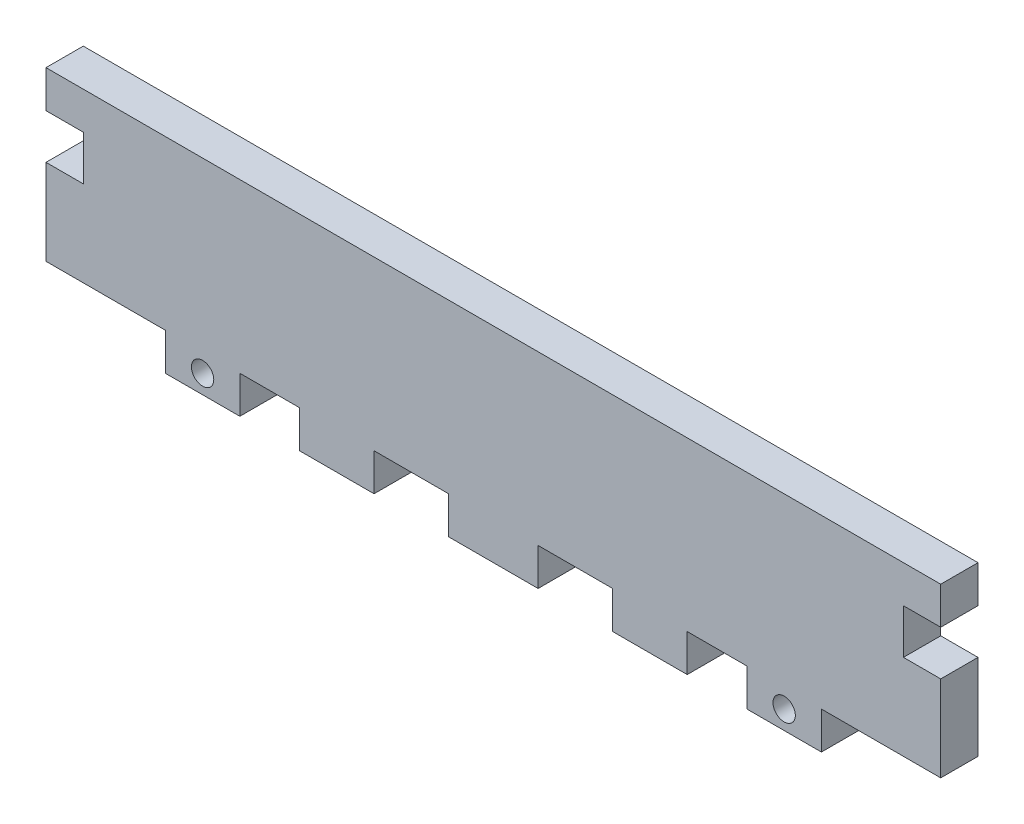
from build123d import *

# Parameters (mm, degrees)
BOSS_EXTRUDE1_DEPTH = 6.35
SKETCH2_W           = 15.24
SKETCH2_H           = 6.35
SKETCH2_W_2         = 12.7
BOSS_EXTRUDE2_DEPTH = 6.35
SKETCH3_R           = 1.905
CUT_EXTRUDE1_DEPTH  = 19.05


with BuildPart() as part:
    # Sketch1 → Boss-Extrude1 (new body)
    with BuildSketch(Plane.XY):
        Polygon((0, 28.575), (-76.2, 28.575), (-76.2, 0), (0, 0), (0, 14.605), (-6.35, 14.605), (-6.35, 22.225), (0, 22.225), align=None)
        Polygon((-76.2, 0), (-76.2, 28.575), (-152.4, 28.575), (-152.4, 22.225), (-146.05, 22.225), (-146.05, 14.605), (-152.4, 14.605), (-152.4, 0), align=None)
    extrude(amount=BOSS_EXTRUDE1_DEPTH)

    # Sketch2 → Boss-Extrude2 (add)
    with BuildSketch(Plane.XZ):
        with Locations((-76.2, 3.175)):
            Rectangle(SKETCH2_W, SKETCH2_H)
        with Locations((-125.73, 3.175)):
            Rectangle(SKETCH2_W_2, SKETCH2_H)
        with Locations((-102.87, 3.175)):
            Rectangle(SKETCH2_W_2, SKETCH2_H)
        with Locations((-26.67, 3.175)):
            Rectangle(SKETCH2_W_2, SKETCH2_H)
        with Locations((-49.53, 3.175)):
            Rectangle(SKETCH2_W_2, SKETCH2_H)
    extrude(amount=BOSS_EXTRUDE2_DEPTH)

    # Sketch3 → Cut-Extrude1 (cut)
    with BuildSketch(Plane.XY.offset(6.35)):
        with Locations((-125.73, -3.175)):
            Circle(SKETCH3_R)
        with Locations((-26.67, -3.175)):
            Circle(SKETCH3_R)
    extrude(amount=-CUT_EXTRUDE1_DEPTH, mode=Mode.SUBTRACT)


solid = part.part
